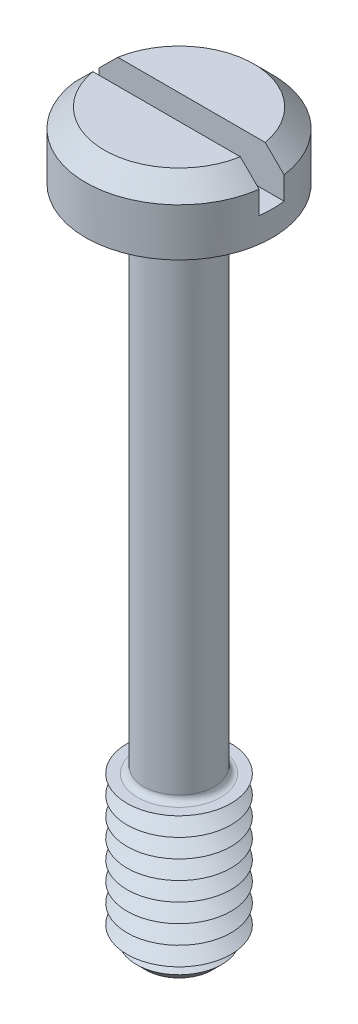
ISO-10303-21;
HEADER;
FILE_DESCRIPTION(('STEP AP214'),'2;1');
FILE_NAME('part.step','',(''),(''),'','','');
FILE_SCHEMA(('AUTOMOTIVE_DESIGN { 1 0 10303 214 1 1 1 1 }'));
ENDSEC;
DATA;
#1=APPLICATION_CONTEXT('core data for automotive mechanical design processes');
#2=APPLICATION_PROTOCOL_DEFINITION('international standard','automotive_design',2000,#1);
#3=PRODUCT_CONTEXT('',#1,'mechanical');
#4=PRODUCT('Part','Part','',(#3));
#5=PRODUCT_RELATED_PRODUCT_CATEGORY('part','',(#4));
#6=PRODUCT_DEFINITION_FORMATION('','',#4);
#7=PRODUCT_DEFINITION_CONTEXT('part definition',#1,'design');
#8=PRODUCT_DEFINITION('design','',#6,#7);
#9=PRODUCT_DEFINITION_SHAPE('','',#8);
#10=(LENGTH_UNIT() NAMED_UNIT(*) SI_UNIT(.MILLI.,.METRE.));
#11=(NAMED_UNIT(*) PLANE_ANGLE_UNIT() SI_UNIT($,.RADIAN.));
#12=(NAMED_UNIT(*) SI_UNIT($,.STERADIAN.) SOLID_ANGLE_UNIT());
#13=UNCERTAINTY_MEASURE_WITH_UNIT(LENGTH_MEASURE(1.E-05),#10,'distance_accuracy_value','');
#14=(GEOMETRIC_REPRESENTATION_CONTEXT(3) GLOBAL_UNCERTAINTY_ASSIGNED_CONTEXT((#13)) GLOBAL_UNIT_ASSIGNED_CONTEXT((#10,
#11,#12)) REPRESENTATION_CONTEXT('',''));
#15=CARTESIAN_POINT('',(0.,0.,0.));
#16=DIRECTION('',(0.,0.,1.));
#17=DIRECTION('',(1.,0.,0.));
#18=AXIS2_PLACEMENT_3D('',#15,#16,#17);
#19=CARTESIAN_POINT('',(0.,1.6,0.));
#20=DIRECTION('',(0.,1.,0.));
#21=DIRECTION('',(0.,0.,1.));
#22=AXIS2_PLACEMENT_3D('',#19,#20,#21);
#23=PLANE('',#22);
#24=DIRECTION('',(-1.,0.,0.));
#25=VECTOR('',#24,1.);
#26=CARTESIAN_POINT('',(2.25,1.6,-0.3));
#27=LINE('',#26,#25);
#28=CARTESIAN_POINT('',(1.77482393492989,1.6,-0.3));
#29=VERTEX_POINT('',#28);
#30=CARTESIAN_POINT('',(-1.77482393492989,1.6,-0.3));
#31=VERTEX_POINT('',#30);
#32=EDGE_CURVE('E110',#29,#31,#27,.T.);
#33=ORIENTED_EDGE('',*,*,#32,.F.);
#34=CARTESIAN_POINT('',(0.,1.6,0.));
#35=DIRECTION('',(0.,1.,0.));
#36=DIRECTION('',(0.,0.,1.));
#37=AXIS2_PLACEMENT_3D('',#34,#35,#36);
#38=CIRCLE('',#37,1.8);
#39=EDGE_CURVE('E113',#29,#31,#38,.T.);
#40=ORIENTED_EDGE('',*,*,#39,.T.);
#41=EDGE_LOOP('',(#33,#40));
#42=FACE_BOUND('',#41,.T.);
#43=ADVANCED_FACE('F39',(#42),#23,.T.);
#44=CARTESIAN_POINT('',(0.,1.6,0.));
#45=DIRECTION('',(0.,-1.,0.));
#46=DIRECTION('',(0.,0.,-1.));
#47=AXIS2_PLACEMENT_3D('',#44,#45,#46);
#48=CONICAL_SURFACE('',#47,1.8,0.785398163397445);
#49=CARTESIAN_POINT('',(4.95459224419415,-1.56366641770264,-0.3));
#50=CARTESIAN_POINT('',(4.78550585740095,-1.39489159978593,-0.3));
#51=CARTESIAN_POINT('',(4.6164059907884,-1.22613027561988,-0.3));
#52=CARTESIAN_POINT('',(4.27815962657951,-0.888649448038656,-0.3));
#53=CARTESIAN_POINT('',(4.10901312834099,-0.719929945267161,-0.3));
#54=CARTESIAN_POINT('',(3.77060374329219,-0.382497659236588,-0.3));
#55=CARTESIAN_POINT('',(3.60134083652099,-0.213784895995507,-0.3));
#56=CARTESIAN_POINT('',(3.26272497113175,0.123545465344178,-0.3));
#57=CARTESIAN_POINT('',(3.09337201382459,0.292163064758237,-0.3));
#58=CARTESIAN_POINT('',(2.74975444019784,0.633985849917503,-0.3));
#59=CARTESIAN_POINT('',(2.57548557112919,0.807186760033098,-0.3));
#60=CARTESIAN_POINT('',(2.22666801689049,1.15332162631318,-0.3));
#61=CARTESIAN_POINT('',(2.05211932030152,1.32625557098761,-0.3));
#62=CARTESIAN_POINT('',(1.78988225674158,1.58520097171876,-0.3));
#63=CARTESIAN_POINT('',(1.70241000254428,1.67143125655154,-0.3));
#64=CARTESIAN_POINT('',(1.52723599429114,1.84366185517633,-0.3));
#65=CARTESIAN_POINT('',(1.43953423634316,1.92966216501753,-0.3));
#66=CARTESIAN_POINT('',(1.26375483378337,2.10126365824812,-0.3));
#67=CARTESIAN_POINT('',(1.17567721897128,2.18686487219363,-0.3));
#68=CARTESIAN_POINT('',(0.998839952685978,2.35735922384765,-0.3));
#69=CARTESIAN_POINT('',(0.910080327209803,2.44225238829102,-0.3));
#70=CARTESIAN_POINT('',(0.796416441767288,2.54899153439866,-0.3));
#71=CARTESIAN_POINT('',(0.772225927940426,2.57159630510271,-0.3));
#72=CARTESIAN_POINT('',(0.723692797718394,2.61664290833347,-0.3));
#73=CARTESIAN_POINT('',(0.699350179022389,2.63908473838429,-0.3));
#74=CARTESIAN_POINT('',(0.650528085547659,2.68369783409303,-0.3));
#75=CARTESIAN_POINT('',(0.626049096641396,2.70586963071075,-0.3));
#76=CARTESIAN_POINT('',(0.576826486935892,2.74991696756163,-0.3));
#77=CARTESIAN_POINT('',(0.552082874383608,2.7717925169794,-0.3));
#78=CARTESIAN_POINT('',(0.495367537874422,2.82108684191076,-0.3));
#79=CARTESIAN_POINT('',(0.463281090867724,2.84837386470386,-0.3));
#80=CARTESIAN_POINT('',(0.398023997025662,2.90193742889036,-0.3));
#81=CARTESIAN_POINT('',(0.364849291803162,2.92820913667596,-0.3));
#82=CARTESIAN_POINT('',(0.313679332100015,2.96610502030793,-0.3));
#83=CARTESIAN_POINT('',(0.296293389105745,2.97854603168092,-0.3));
#84=CARTESIAN_POINT('',(0.260958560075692,3.0025951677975,-0.3));
#85=CARTESIAN_POINT('',(0.243009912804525,3.01420363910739,-0.3));
#86=CARTESIAN_POINT('',(0.206442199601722,3.0361249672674,-0.3));
#87=CARTESIAN_POINT('',(0.187826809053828,3.04644383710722,-0.3));
#88=CARTESIAN_POINT('',(0.149667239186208,3.06515059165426,-0.3));
#89=CARTESIAN_POINT('',(0.130125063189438,3.0735424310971,-0.3));
#90=CARTESIAN_POINT('',(0.089977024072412,3.08736060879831,-0.3));
#91=CARTESIAN_POINT('',(0.0693720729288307,3.09278944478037,-0.3));
#92=CARTESIAN_POINT('',(0.0275643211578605,3.0994305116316,-0.3));
#93=CARTESIAN_POINT('',(0.00636584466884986,3.10066782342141,-0.3));
#94=CARTESIAN_POINT('',(-0.0358007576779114,3.09861060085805,-0.3));
#95=CARTESIAN_POINT('',(-0.0567687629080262,3.09531379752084,-0.3));
#96=CARTESIAN_POINT('',(-0.097873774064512,3.08507807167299,-0.3));
#97=CARTESIAN_POINT('',(-0.118004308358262,3.07811501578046,-0.3));
#98=CARTESIAN_POINT('',(-0.162483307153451,3.05957916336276,-0.3));
#99=CARTESIAN_POINT('',(-0.186511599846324,3.04727044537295,-0.3));
#100=CARTESIAN_POINT('',(-0.23331864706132,3.02043354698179,-0.3));
#101=CARTESIAN_POINT('',(-0.256093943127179,3.00589960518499,-0.3));
#102=CARTESIAN_POINT('',(-0.300901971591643,2.97541580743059,-0.3));
#103=CARTESIAN_POINT('',(-0.322928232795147,2.95945657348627,-0.3));
#104=CARTESIAN_POINT('',(-0.366316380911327,2.92672827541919,-0.3));
#105=CARTESIAN_POINT('',(-0.387679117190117,2.90996032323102,-0.3));
#106=CARTESIAN_POINT('',(-0.433394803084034,2.87310399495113,-0.3));
#107=CARTESIAN_POINT('',(-0.457669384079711,2.85291891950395,-0.3));
#108=CARTESIAN_POINT('',(-0.505802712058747,2.81205752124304,-0.3));
#109=CARTESIAN_POINT('',(-0.529661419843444,2.79138115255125,-0.3));
#110=CARTESIAN_POINT('',(-0.600811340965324,2.72884009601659,-0.3));
#111=CARTESIAN_POINT('',(-0.647661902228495,2.68647545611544,-0.3));
#112=CARTESIAN_POINT('',(-0.740776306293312,2.60099002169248,-0.3));
#113=CARTESIAN_POINT('',(-0.787039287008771,2.55786829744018,-0.3));
#114=CARTESIAN_POINT('',(-0.879151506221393,2.4712020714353,-0.3));
#115=CARTESIAN_POINT('',(-0.92500081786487,2.42765764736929,-0.3));
#116=CARTESIAN_POINT('',(-1.0615734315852,2.29718252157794,-0.3));
#117=CARTESIAN_POINT('',(-1.15191647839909,2.20985470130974,-0.3));
#118=CARTESIAN_POINT('',(-1.33204374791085,2.03474740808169,-0.3));
#119=CARTESIAN_POINT('',(-1.42182830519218,1.94696827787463,-0.3));
#120=CARTESIAN_POINT('',(-1.65511823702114,1.71815111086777,-0.3));
#121=CARTESIAN_POINT('',(-1.79840096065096,1.57688614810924,-0.3));
#122=CARTESIAN_POINT('',(-2.08462326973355,1.29400744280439,-0.3));
#123=CARTESIAN_POINT('',(-2.22756285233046,1.15239369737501,-0.3));
#124=CARTESIAN_POINT('',(-2.65618391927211,0.727177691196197,-0.3));
#125=CARTESIAN_POINT('',(-2.94157972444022,0.443287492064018,-0.3));
#126=CARTESIAN_POINT('',(-3.51504981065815,-0.127735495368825,-0.3));
#127=CARTESIAN_POINT('',(-3.80312108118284,-0.414871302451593,-0.3));
#128=CARTESIAN_POINT('',(-4.37899985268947,-0.98921931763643,-0.3));
#129=CARTESIAN_POINT('',(-4.6668074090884,-1.27643147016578,-0.3));
#130=CARTESIAN_POINT('',(-4.95459224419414,-1.56366641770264,-0.3));
#131=B_SPLINE_CURVE_WITH_KNOTS('',3,(#49,#50,#51,#52,#53,#54,#55,#56,#57,#58,#59,#60,#61,#62,
#63,#64,#65,#66,#67,#68,#69,#70,#71,#72,#73,#74,#75,#76,#77,#78,#79,#80,#81,#82,#83,#84,#85,#86,
#87,#88,#89,#90,#91,#92,#93,#94,#95,#96,#97,#98,#99,#100,#101,#102,#103,#104,#105,#106,#107,
#108,#109,#110,#111,#112,#113,#114,#115,#116,#117,#118,#119,#120,#121,#122,#123,#124,#125,#126,
#127,#128,#129,#130),.UNSPECIFIED.,.F.,.F.,(4,2,2,2,2,2,2,2,2,2,2,2,2,2,2,2,2,2,2,2,2,2,2,2,2,2,
2,2,2,2,2,2,2,2,2,2,2,2,2,2,4),(0.,0.716712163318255,1.43343474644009,2.1503903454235,
2.86733577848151,3.6044339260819,4.3415629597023,4.71005096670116,5.07854526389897,
5.44701086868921,5.81546249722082,5.91478669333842,6.01411239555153,6.11319302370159,
6.21227057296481,6.33862193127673,6.46551497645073,6.52963544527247,6.59372906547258,
6.65751170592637,6.72116225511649,6.78475906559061,6.84797465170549,6.91122188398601,
6.97489074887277,7.05566851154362,7.13665907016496,7.21822852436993,7.29968885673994,
7.39438996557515,7.48909995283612,7.67857624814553,7.86830424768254,8.05799801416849,
8.43494407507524,8.81163695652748,9.41526715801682,10.0189023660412,11.2265436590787,
12.4467437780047,13.6665454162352),.UNSPECIFIED.);
#132=CARTESIAN_POINT('',(2.2299103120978,1.14999999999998,-0.3));
#133=VERTEX_POINT('',#132);
#134=EDGE_CURVE('E260',#133,#29,#131,.T.);
#135=ORIENTED_EDGE('',*,*,#134,.F.);
#136=CARTESIAN_POINT('',(0.,1.15,0.));
#137=DIRECTION('',(0.,1.,0.));
#138=DIRECTION('',(0.,0.,1.));
#139=AXIS2_PLACEMENT_3D('',#136,#137,#138);
#140=CIRCLE('',#139,2.25);
#141=CARTESIAN_POINT('',(-2.22991031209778,1.15,-0.3));
#142=VERTEX_POINT('',#141);
#143=EDGE_CURVE('E128',#142,#133,#140,.F.);
#144=ORIENTED_EDGE('',*,*,#143,.F.);
#145=EDGE_CURVE('E102',#31,#142,#131,.T.);
#146=ORIENTED_EDGE('',*,*,#145,.F.);
#147=ORIENTED_EDGE('',*,*,#39,.F.);
#148=EDGE_LOOP('',(#135,#144,#146,#147));
#149=FACE_BOUND('',#148,.T.);
#150=ADVANCED_FACE('F222',(#149),#48,.T.);
#151=CARTESIAN_POINT('',(0.,-16.,0.));
#152=DIRECTION('',(0.,1.,0.));
#153=DIRECTION('',(0.,0.,1.));
#154=AXIS2_PLACEMENT_3D('',#151,#152,#153);
#155=CYLINDRICAL_SURFACE('',#154,0.85);
#156=CARTESIAN_POINT('',(0.,-12.15,0.));
#157=DIRECTION('',(0.,-1.,0.));
#158=DIRECTION('',(0.,0.,-1.));
#159=AXIS2_PLACEMENT_3D('',#156,#157,#158);
#160=CIRCLE('',#159,0.85);
#161=CARTESIAN_POINT('',(0.,-12.15,-0.85));
#162=VERTEX_POINT('',#161);
#163=EDGE_CURVE('E123',#162,#162,#160,.F.);
#164=ORIENTED_EDGE('',*,*,#163,.T.);
#165=EDGE_LOOP('',(#164));
#166=FACE_BOUND('',#165,.T.);
#167=CARTESIAN_POINT('',(0.,-0.150000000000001,0.));
#168=DIRECTION('',(0.,1.,0.));
#169=DIRECTION('',(0.,0.,1.));
#170=AXIS2_PLACEMENT_3D('',#167,#168,#169);
#171=CIRCLE('',#170,0.85);
#172=CARTESIAN_POINT('',(0.,-0.150000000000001,0.85));
#173=VERTEX_POINT('',#172);
#174=EDGE_CURVE('E366',#173,#173,#171,.F.);
#175=ORIENTED_EDGE('',*,*,#174,.T.);
#176=EDGE_LOOP('',(#175));
#177=FACE_BOUND('',#176,.T.);
#178=ADVANCED_FACE('F218',(#166,#177),#155,.T.);
#179=CARTESIAN_POINT('',(0.,1.6,0.));
#180=DIRECTION('',(0.,-1.,0.));
#181=DIRECTION('',(0.,0.,-1.));
#182=AXIS2_PLACEMENT_3D('',#179,#180,#181);
#183=CYLINDRICAL_SURFACE('',#182,2.25);
#184=ORIENTED_EDGE('',*,*,#143,.T.);
#185=DIRECTION('',(0.,-1.,0.));
#186=VECTOR('',#185,1.);
#187=CARTESIAN_POINT('',(2.22991031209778,1.6,-0.3));
#188=LINE('',#187,#186);
#189=CARTESIAN_POINT('',(2.22991031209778,0.6,-0.3));
#190=VERTEX_POINT('',#189);
#191=EDGE_CURVE('E64',#133,#190,#188,.T.);
#192=ORIENTED_EDGE('',*,*,#191,.T.);
#193=CARTESIAN_POINT('',(0.,0.6,0.));
#194=DIRECTION('',(0.,1.,0.));
#195=DIRECTION('',(0.,0.,1.));
#196=AXIS2_PLACEMENT_3D('',#193,#194,#195);
#197=CIRCLE('',#196,2.25);
#198=CARTESIAN_POINT('',(2.22991031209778,0.6,0.3));
#199=VERTEX_POINT('',#198);
#200=EDGE_CURVE('E11',#199,#190,#197,.T.);
#201=ORIENTED_EDGE('',*,*,#200,.F.);
#202=DIRECTION('',(0.,-1.,0.));
#203=VECTOR('',#202,1.);
#204=CARTESIAN_POINT('',(2.22991031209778,1.6,0.3));
#205=LINE('',#204,#203);
#206=CARTESIAN_POINT('',(2.22991031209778,1.15,0.3));
#207=VERTEX_POINT('',#206);
#208=EDGE_CURVE('E277',#199,#207,#205,.F.);
#209=ORIENTED_EDGE('',*,*,#208,.T.);
#210=CARTESIAN_POINT('',(-2.2299103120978,1.14999999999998,0.3));
#211=VERTEX_POINT('',#210);
#212=EDGE_CURVE('E120',#207,#211,#140,.F.);
#213=ORIENTED_EDGE('',*,*,#212,.T.);
#214=DIRECTION('',(0.,-1.,0.));
#215=VECTOR('',#214,1.);
#216=CARTESIAN_POINT('',(-2.22991031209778,1.6,0.3));
#217=LINE('',#216,#215);
#218=CARTESIAN_POINT('',(-2.22991031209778,0.6,0.3));
#219=VERTEX_POINT('',#218);
#220=EDGE_CURVE('E96',#211,#219,#217,.T.);
#221=ORIENTED_EDGE('',*,*,#220,.T.);
#222=CARTESIAN_POINT('',(-2.22991031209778,0.6,-0.3));
#223=VERTEX_POINT('',#222);
#224=EDGE_CURVE('E44',#223,#219,#197,.T.);
#225=ORIENTED_EDGE('',*,*,#224,.F.);
#226=DIRECTION('',(0.,-1.,0.));
#227=VECTOR('',#226,1.);
#228=CARTESIAN_POINT('',(-2.22991031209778,1.6,-0.3));
#229=LINE('',#228,#227);
#230=EDGE_CURVE('E281',#223,#142,#229,.F.);
#231=ORIENTED_EDGE('',*,*,#230,.T.);
#232=EDGE_LOOP('',(#184,#192,#201,#209,#213,#221,#225,#231));
#233=FACE_BOUND('',#232,.T.);
#234=CARTESIAN_POINT('',(0.,0.,0.));
#235=DIRECTION('',(0.,1.,0.));
#236=DIRECTION('',(0.,0.,1.));
#237=AXIS2_PLACEMENT_3D('',#234,#235,#236);
#238=CIRCLE('',#237,2.25);
#239=CARTESIAN_POINT('',(0.,0.,2.25));
#240=VERTEX_POINT('',#239);
#241=EDGE_CURVE('E352',#240,#240,#238,.T.);
#242=ORIENTED_EDGE('',*,*,#241,.T.);
#243=EDGE_LOOP('',(#242));
#244=FACE_BOUND('',#243,.T.);
#245=ADVANCED_FACE('F221',(#233,#244),#183,.T.);
#246=DIRECTION('',(1.,0.,0.));
#247=VECTOR('',#246,1.);
#248=CARTESIAN_POINT('',(2.25,1.6,0.3));
#249=LINE('',#248,#247);
#250=CARTESIAN_POINT('',(-1.77482393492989,1.6,0.3));
#251=VERTEX_POINT('',#250);
#252=CARTESIAN_POINT('',(1.77482393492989,1.6,0.3));
#253=VERTEX_POINT('',#252);
#254=EDGE_CURVE('E56',#251,#253,#249,.T.);
#255=ORIENTED_EDGE('',*,*,#254,.F.);
#256=EDGE_CURVE('E108',#251,#253,#38,.T.);
#257=ORIENTED_EDGE('',*,*,#256,.T.);
#258=EDGE_LOOP('',(#255,#257));
#259=FACE_BOUND('',#258,.T.);
#260=ADVANCED_FACE('F107',(#259),#23,.T.);
#261=CARTESIAN_POINT('',(0.,0.,0.));
#262=DIRECTION('',(0.,1.,0.));
#263=DIRECTION('',(0.,0.,1.));
#264=AXIS2_PLACEMENT_3D('',#261,#262,#263);
#265=PLANE('',#264);
#266=CARTESIAN_POINT('',(0.,0.,0.));
#267=DIRECTION('',(0.,1.,0.));
#268=DIRECTION('',(0.,0.,1.));
#269=AXIS2_PLACEMENT_3D('',#266,#267,#268);
#270=CIRCLE('',#269,1.);
#271=CARTESIAN_POINT('',(0.,0.,1.));
#272=VERTEX_POINT('',#271);
#273=EDGE_CURVE('E114',#272,#272,#270,.T.);
#274=ORIENTED_EDGE('',*,*,#273,.T.);
#275=EDGE_LOOP('',(#274));
#276=FACE_BOUND('',#275,.T.);
#277=ORIENTED_EDGE('',*,*,#241,.F.);
#278=EDGE_LOOP('',(#277));
#279=FACE_BOUND('',#278,.T.);
#280=ADVANCED_FACE('F212',(#276,#279),#265,.F.);
#281=CARTESIAN_POINT('',(0.,-12.3,0.));
#282=DIRECTION('',(0.,-1.,0.));
#283=DIRECTION('',(0.,0.,-1.));
#284=AXIS2_PLACEMENT_3D('',#281,#282,#283);
#285=PLANE('',#284);
#286=CARTESIAN_POINT('',(0.,-12.3,0.));
#287=DIRECTION('',(0.,-1.,0.));
#288=DIRECTION('',(0.,0.,-1.));
#289=AXIS2_PLACEMENT_3D('',#286,#287,#288);
#290=CIRCLE('',#289,1.);
#291=CARTESIAN_POINT('',(0.,-12.3,-1.));
#292=VERTEX_POINT('',#291);
#293=EDGE_CURVE('E359',#292,#292,#290,.T.);
#294=ORIENTED_EDGE('',*,*,#293,.T.);
#295=EDGE_LOOP('',(#294));
#296=FACE_BOUND('',#295,.T.);
#297=CARTESIAN_POINT('',(0.,-12.3,0.));
#298=DIRECTION('',(0.,1.,0.));
#299=DIRECTION('',(0.,0.,1.));
#300=AXIS2_PLACEMENT_3D('',#297,#298,#299);
#301=CIRCLE('',#300,1.25);
#302=CARTESIAN_POINT('',(0.,-12.3,1.25));
#303=VERTEX_POINT('',#302);
#304=EDGE_CURVE('E348',#303,#303,#301,.T.);
#305=ORIENTED_EDGE('',*,*,#304,.T.);
#306=EDGE_LOOP('',(#305));
#307=FACE_BOUND('',#306,.T.);
#308=ADVANCED_FACE('F208',(#296,#307),#285,.F.);
#309=CARTESIAN_POINT('',(0.,-12.525,0.));
#310=DIRECTION('',(0.,1.,0.));
#311=DIRECTION('',(0.,0.,1.));
#312=AXIS2_PLACEMENT_3D('',#309,#310,#311);
#313=CONICAL_SURFACE('',#312,0.860288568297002,1.0471975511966);
#314=ORIENTED_EDGE('',*,*,#304,.F.);
#315=EDGE_LOOP('',(#314));
#316=FACE_BOUND('',#315,.T.);
#317=CARTESIAN_POINT('',(0.,-12.525,0.));
#318=DIRECTION('',(0.,1.,0.));
#319=DIRECTION('',(0.,0.,1.));
#320=AXIS2_PLACEMENT_3D('',#317,#318,#319);
#321=CIRCLE('',#320,0.860288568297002);
#322=CARTESIAN_POINT('',(0.,-12.525,0.860288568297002));
#323=VERTEX_POINT('',#322);
#324=EDGE_CURVE('E344',#323,#323,#321,.T.);
#325=ORIENTED_EDGE('',*,*,#324,.T.);
#326=EDGE_LOOP('',(#325));
#327=FACE_BOUND('',#326,.T.);
#328=ADVANCED_FACE('F204',(#316,#327),#313,.T.);
#329=CARTESIAN_POINT('',(0.,-12.75,0.));
#330=DIRECTION('',(0.,-1.,0.));
#331=DIRECTION('',(0.,0.,-1.));
#332=AXIS2_PLACEMENT_3D('',#329,#330,#331);
#333=CONICAL_SURFACE('',#332,1.25,1.0471975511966);
#334=ORIENTED_EDGE('',*,*,#324,.F.);
#335=EDGE_LOOP('',(#334));
#336=FACE_BOUND('',#335,.T.);
#337=CARTESIAN_POINT('',(0.,-12.75,0.));
#338=DIRECTION('',(0.,1.,0.));
#339=DIRECTION('',(0.,0.,1.));
#340=AXIS2_PLACEMENT_3D('',#337,#338,#339);
#341=CIRCLE('',#340,1.25);
#342=CARTESIAN_POINT('',(0.,-12.75,1.25));
#343=VERTEX_POINT('',#342);
#344=EDGE_CURVE('E340',#343,#343,#341,.T.);
#345=ORIENTED_EDGE('',*,*,#344,.T.);
#346=EDGE_LOOP('',(#345));
#347=FACE_BOUND('',#346,.T.);
#348=ADVANCED_FACE('F200',(#336,#347),#333,.T.);
#349=CARTESIAN_POINT('',(0.,-12.975,0.));
#350=DIRECTION('',(0.,1.,0.));
#351=DIRECTION('',(0.,0.,1.));
#352=AXIS2_PLACEMENT_3D('',#349,#350,#351);
#353=CONICAL_SURFACE('',#352,0.860288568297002,1.0471975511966);
#354=ORIENTED_EDGE('',*,*,#344,.F.);
#355=EDGE_LOOP('',(#354));
#356=FACE_BOUND('',#355,.T.);
#357=CARTESIAN_POINT('',(0.,-12.975,0.));
#358=DIRECTION('',(0.,1.,0.));
#359=DIRECTION('',(0.,0.,1.));
#360=AXIS2_PLACEMENT_3D('',#357,#358,#359);
#361=CIRCLE('',#360,0.860288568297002);
#362=CARTESIAN_POINT('',(0.,-12.975,0.860288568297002));
#363=VERTEX_POINT('',#362);
#364=EDGE_CURVE('E337',#363,#363,#361,.T.);
#365=ORIENTED_EDGE('',*,*,#364,.T.);
#366=EDGE_LOOP('',(#365));
#367=FACE_BOUND('',#366,.T.);
#368=ADVANCED_FACE('F196',(#356,#367),#353,.T.);
#369=CARTESIAN_POINT('',(0.,-13.2,0.));
#370=DIRECTION('',(0.,-1.,0.));
#371=DIRECTION('',(0.,0.,-1.));
#372=AXIS2_PLACEMENT_3D('',#369,#370,#371);
#373=CONICAL_SURFACE('',#372,1.25,1.0471975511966);
#374=ORIENTED_EDGE('',*,*,#364,.F.);
#375=EDGE_LOOP('',(#374));
#376=FACE_BOUND('',#375,.T.);
#377=CARTESIAN_POINT('',(0.,-13.2,0.));
#378=DIRECTION('',(0.,1.,0.));
#379=DIRECTION('',(0.,0.,1.));
#380=AXIS2_PLACEMENT_3D('',#377,#378,#379);
#381=CIRCLE('',#380,1.25);
#382=CARTESIAN_POINT('',(0.,-13.2,1.25));
#383=VERTEX_POINT('',#382);
#384=EDGE_CURVE('E333',#383,#383,#381,.T.);
#385=ORIENTED_EDGE('',*,*,#384,.T.);
#386=EDGE_LOOP('',(#385));
#387=FACE_BOUND('',#386,.T.);
#388=ADVANCED_FACE('F192',(#376,#387),#373,.T.);
#389=CARTESIAN_POINT('',(0.,-13.425,0.));
#390=DIRECTION('',(0.,1.,0.));
#391=DIRECTION('',(0.,0.,1.));
#392=AXIS2_PLACEMENT_3D('',#389,#390,#391);
#393=CONICAL_SURFACE('',#392,0.860288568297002,1.0471975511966);
#394=ORIENTED_EDGE('',*,*,#384,.F.);
#395=EDGE_LOOP('',(#394));
#396=FACE_BOUND('',#395,.T.);
#397=CARTESIAN_POINT('',(0.,-13.425,0.));
#398=DIRECTION('',(0.,1.,0.));
#399=DIRECTION('',(0.,0.,1.));
#400=AXIS2_PLACEMENT_3D('',#397,#398,#399);
#401=CIRCLE('',#400,0.860288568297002);
#402=CARTESIAN_POINT('',(0.,-13.425,0.860288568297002));
#403=VERTEX_POINT('',#402);
#404=EDGE_CURVE('E329',#403,#403,#401,.T.);
#405=ORIENTED_EDGE('',*,*,#404,.T.);
#406=EDGE_LOOP('',(#405));
#407=FACE_BOUND('',#406,.T.);
#408=ADVANCED_FACE('F188',(#396,#407),#393,.T.);
#409=CARTESIAN_POINT('',(0.,-13.65,0.));
#410=DIRECTION('',(0.,-1.,0.));
#411=DIRECTION('',(0.,0.,-1.));
#412=AXIS2_PLACEMENT_3D('',#409,#410,#411);
#413=CONICAL_SURFACE('',#412,1.25,1.0471975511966);
#414=ORIENTED_EDGE('',*,*,#404,.F.);
#415=EDGE_LOOP('',(#414));
#416=FACE_BOUND('',#415,.T.);
#417=CARTESIAN_POINT('',(0.,-13.65,0.));
#418=DIRECTION('',(0.,1.,0.));
#419=DIRECTION('',(0.,0.,1.));
#420=AXIS2_PLACEMENT_3D('',#417,#418,#419);
#421=CIRCLE('',#420,1.25);
#422=CARTESIAN_POINT('',(0.,-13.65,1.25));
#423=VERTEX_POINT('',#422);
#424=EDGE_CURVE('E325',#423,#423,#421,.T.);
#425=ORIENTED_EDGE('',*,*,#424,.T.);
#426=EDGE_LOOP('',(#425));
#427=FACE_BOUND('',#426,.T.);
#428=ADVANCED_FACE('F184',(#416,#427),#413,.T.);
#429=CARTESIAN_POINT('',(0.,-13.875,0.));
#430=DIRECTION('',(0.,1.,0.));
#431=DIRECTION('',(0.,0.,1.));
#432=AXIS2_PLACEMENT_3D('',#429,#430,#431);
#433=CONICAL_SURFACE('',#432,0.860288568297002,1.0471975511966);
#434=ORIENTED_EDGE('',*,*,#424,.F.);
#435=EDGE_LOOP('',(#434));
#436=FACE_BOUND('',#435,.T.);
#437=CARTESIAN_POINT('',(0.,-13.875,0.));
#438=DIRECTION('',(0.,1.,0.));
#439=DIRECTION('',(0.,0.,1.));
#440=AXIS2_PLACEMENT_3D('',#437,#438,#439);
#441=CIRCLE('',#440,0.860288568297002);
#442=CARTESIAN_POINT('',(0.,-13.875,0.860288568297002));
#443=VERTEX_POINT('',#442);
#444=EDGE_CURVE('E321',#443,#443,#441,.T.);
#445=ORIENTED_EDGE('',*,*,#444,.T.);
#446=EDGE_LOOP('',(#445));
#447=FACE_BOUND('',#446,.T.);
#448=ADVANCED_FACE('F180',(#436,#447),#433,.T.);
#449=CARTESIAN_POINT('',(0.,-14.1,0.));
#450=DIRECTION('',(0.,-1.,0.));
#451=DIRECTION('',(0.,0.,-1.));
#452=AXIS2_PLACEMENT_3D('',#449,#450,#451);
#453=CONICAL_SURFACE('',#452,1.25,1.0471975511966);
#454=ORIENTED_EDGE('',*,*,#444,.F.);
#455=EDGE_LOOP('',(#454));
#456=FACE_BOUND('',#455,.T.);
#457=CARTESIAN_POINT('',(0.,-14.1,0.));
#458=DIRECTION('',(0.,1.,0.));
#459=DIRECTION('',(0.,0.,1.));
#460=AXIS2_PLACEMENT_3D('',#457,#458,#459);
#461=CIRCLE('',#460,1.25);
#462=CARTESIAN_POINT('',(0.,-14.1,1.25));
#463=VERTEX_POINT('',#462);
#464=EDGE_CURVE('E317',#463,#463,#461,.T.);
#465=ORIENTED_EDGE('',*,*,#464,.T.);
#466=EDGE_LOOP('',(#465));
#467=FACE_BOUND('',#466,.T.);
#468=ADVANCED_FACE('F176',(#456,#467),#453,.T.);
#469=CARTESIAN_POINT('',(0.,-14.325,0.));
#470=DIRECTION('',(0.,1.,0.));
#471=DIRECTION('',(0.,0.,1.));
#472=AXIS2_PLACEMENT_3D('',#469,#470,#471);
#473=CONICAL_SURFACE('',#472,0.860288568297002,1.0471975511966);
#474=ORIENTED_EDGE('',*,*,#464,.F.);
#475=EDGE_LOOP('',(#474));
#476=FACE_BOUND('',#475,.T.);
#477=CARTESIAN_POINT('',(0.,-14.325,0.));
#478=DIRECTION('',(0.,1.,0.));
#479=DIRECTION('',(0.,0.,1.));
#480=AXIS2_PLACEMENT_3D('',#477,#478,#479);
#481=CIRCLE('',#480,0.860288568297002);
#482=CARTESIAN_POINT('',(0.,-14.325,0.860288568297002));
#483=VERTEX_POINT('',#482);
#484=EDGE_CURVE('E313',#483,#483,#481,.T.);
#485=ORIENTED_EDGE('',*,*,#484,.T.);
#486=EDGE_LOOP('',(#485));
#487=FACE_BOUND('',#486,.T.);
#488=ADVANCED_FACE('F172',(#476,#487),#473,.T.);
#489=CARTESIAN_POINT('',(0.,-14.55,0.));
#490=DIRECTION('',(0.,-1.,0.));
#491=DIRECTION('',(0.,0.,-1.));
#492=AXIS2_PLACEMENT_3D('',#489,#490,#491);
#493=CONICAL_SURFACE('',#492,1.25,1.0471975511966);
#494=ORIENTED_EDGE('',*,*,#484,.F.);
#495=EDGE_LOOP('',(#494));
#496=FACE_BOUND('',#495,.T.);
#497=CARTESIAN_POINT('',(0.,-14.55,0.));
#498=DIRECTION('',(0.,1.,0.));
#499=DIRECTION('',(0.,0.,1.));
#500=AXIS2_PLACEMENT_3D('',#497,#498,#499);
#501=CIRCLE('',#500,1.25);
#502=CARTESIAN_POINT('',(0.,-14.55,1.25));
#503=VERTEX_POINT('',#502);
#504=EDGE_CURVE('E309',#503,#503,#501,.T.);
#505=ORIENTED_EDGE('',*,*,#504,.T.);
#506=EDGE_LOOP('',(#505));
#507=FACE_BOUND('',#506,.T.);
#508=ADVANCED_FACE('F168',(#496,#507),#493,.T.);
#509=CARTESIAN_POINT('',(0.,-14.775,0.));
#510=DIRECTION('',(0.,1.,0.));
#511=DIRECTION('',(0.,0.,1.));
#512=AXIS2_PLACEMENT_3D('',#509,#510,#511);
#513=CONICAL_SURFACE('',#512,0.860288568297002,1.0471975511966);
#514=ORIENTED_EDGE('',*,*,#504,.F.);
#515=EDGE_LOOP('',(#514));
#516=FACE_BOUND('',#515,.T.);
#517=CARTESIAN_POINT('',(0.,-14.775,0.));
#518=DIRECTION('',(0.,1.,0.));
#519=DIRECTION('',(0.,0.,1.));
#520=AXIS2_PLACEMENT_3D('',#517,#518,#519);
#521=CIRCLE('',#520,0.860288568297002);
#522=CARTESIAN_POINT('',(0.,-14.775,0.860288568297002));
#523=VERTEX_POINT('',#522);
#524=EDGE_CURVE('E305',#523,#523,#521,.T.);
#525=ORIENTED_EDGE('',*,*,#524,.T.);
#526=EDGE_LOOP('',(#525));
#527=FACE_BOUND('',#526,.T.);
#528=ADVANCED_FACE('F164',(#516,#527),#513,.T.);
#529=CARTESIAN_POINT('',(0.,-15.,0.));
#530=DIRECTION('',(0.,-1.,0.));
#531=DIRECTION('',(0.,0.,-1.));
#532=AXIS2_PLACEMENT_3D('',#529,#530,#531);
#533=CONICAL_SURFACE('',#532,1.25,1.0471975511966);
#534=ORIENTED_EDGE('',*,*,#524,.F.);
#535=EDGE_LOOP('',(#534));
#536=FACE_BOUND('',#535,.T.);
#537=CARTESIAN_POINT('',(0.,-15.,0.));
#538=DIRECTION('',(0.,1.,0.));
#539=DIRECTION('',(0.,0.,1.));
#540=AXIS2_PLACEMENT_3D('',#537,#538,#539);
#541=CIRCLE('',#540,1.25);
#542=CARTESIAN_POINT('',(0.,-15.,1.25));
#543=VERTEX_POINT('',#542);
#544=EDGE_CURVE('E302',#543,#543,#541,.T.);
#545=ORIENTED_EDGE('',*,*,#544,.T.);
#546=EDGE_LOOP('',(#545));
#547=FACE_BOUND('',#546,.T.);
#548=ADVANCED_FACE('F160',(#536,#547),#533,.T.);
#549=CARTESIAN_POINT('',(0.,-15.225,0.));
#550=DIRECTION('',(0.,1.,0.));
#551=DIRECTION('',(0.,0.,1.));
#552=AXIS2_PLACEMENT_3D('',#549,#550,#551);
#553=CONICAL_SURFACE('',#552,0.860288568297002,1.0471975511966);
#554=ORIENTED_EDGE('',*,*,#544,.F.);
#555=EDGE_LOOP('',(#554));
#556=FACE_BOUND('',#555,.T.);
#557=CARTESIAN_POINT('',(0.,-15.225,0.));
#558=DIRECTION('',(0.,1.,0.));
#559=DIRECTION('',(0.,0.,1.));
#560=AXIS2_PLACEMENT_3D('',#557,#558,#559);
#561=CIRCLE('',#560,0.860288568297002);
#562=CARTESIAN_POINT('',(0.,-15.225,0.860288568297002));
#563=VERTEX_POINT('',#562);
#564=EDGE_CURVE('E299',#563,#563,#561,.T.);
#565=ORIENTED_EDGE('',*,*,#564,.T.);
#566=EDGE_LOOP('',(#565));
#567=FACE_BOUND('',#566,.T.);
#568=ADVANCED_FACE('F156',(#556,#567),#553,.T.);
#569=CARTESIAN_POINT('',(0.,-15.45,0.));
#570=DIRECTION('',(0.,-1.,0.));
#571=DIRECTION('',(0.,0.,-1.));
#572=AXIS2_PLACEMENT_3D('',#569,#570,#571);
#573=CONICAL_SURFACE('',#572,1.25,1.0471975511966);
#574=ORIENTED_EDGE('',*,*,#564,.F.);
#575=EDGE_LOOP('',(#574));
#576=FACE_BOUND('',#575,.T.);
#577=CARTESIAN_POINT('',(0.,-15.45,0.));
#578=DIRECTION('',(0.,1.,0.));
#579=DIRECTION('',(0.,0.,1.));
#580=AXIS2_PLACEMENT_3D('',#577,#578,#579);
#581=CIRCLE('',#580,1.25);
#582=CARTESIAN_POINT('',(0.,-15.45,1.25));
#583=VERTEX_POINT('',#582);
#584=EDGE_CURVE('E294',#583,#583,#581,.T.);
#585=ORIENTED_EDGE('',*,*,#584,.T.);
#586=EDGE_LOOP('',(#585));
#587=FACE_BOUND('',#586,.T.);
#588=ADVANCED_FACE('F152',(#576,#587),#573,.T.);
#589=CARTESIAN_POINT('',(0.,-15.675,0.));
#590=DIRECTION('',(0.,1.,0.));
#591=DIRECTION('',(0.,0.,1.));
#592=AXIS2_PLACEMENT_3D('',#589,#590,#591);
#593=CONICAL_SURFACE('',#592,0.860288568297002,1.0471975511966);
#594=ORIENTED_EDGE('',*,*,#584,.F.);
#595=EDGE_LOOP('',(#594));
#596=FACE_BOUND('',#595,.T.);
#597=CARTESIAN_POINT('',(0.,-15.675,0.));
#598=DIRECTION('',(0.,1.,0.));
#599=DIRECTION('',(0.,0.,1.));
#600=AXIS2_PLACEMENT_3D('',#597,#598,#599);
#601=CIRCLE('',#600,0.860288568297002);
#602=CARTESIAN_POINT('',(0.,-15.675,0.860288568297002));
#603=VERTEX_POINT('',#602);
#604=EDGE_CURVE('E290',#603,#603,#601,.T.);
#605=ORIENTED_EDGE('',*,*,#604,.T.);
#606=EDGE_LOOP('',(#605));
#607=FACE_BOUND('',#606,.T.);
#608=ADVANCED_FACE('F148',(#596,#607),#593,.T.);
#609=CARTESIAN_POINT('',(0.,-15.9,0.));
#610=DIRECTION('',(0.,-1.,0.));
#611=DIRECTION('',(0.,0.,-1.));
#612=AXIS2_PLACEMENT_3D('',#609,#610,#611);
#613=CONICAL_SURFACE('',#612,1.25,1.0471975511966);
#614=CARTESIAN_POINT('',(0.,-15.7718911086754,0.));
#615=DIRECTION('',(0.,-1.,0.));
#616=DIRECTION('',(0.,0.,-1.));
#617=AXIS2_PLACEMENT_3D('',#614,#615,#616);
#618=CIRCLE('',#617,1.02810889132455);
#619=CARTESIAN_POINT('',(0.,-15.7718911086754,-1.02810889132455));
#620=VERTEX_POINT('',#619);
#621=EDGE_CURVE('E298',#620,#620,#618,.F.);
#622=ORIENTED_EDGE('',*,*,#621,.T.);
#623=EDGE_LOOP('',(#622));
#624=FACE_BOUND('',#623,.T.);
#625=ORIENTED_EDGE('',*,*,#604,.F.);
#626=EDGE_LOOP('',(#625));
#627=FACE_BOUND('',#626,.T.);
#628=ADVANCED_FACE('F144',(#624,#627),#613,.T.);
#629=CARTESIAN_POINT('',(0.,-16.,0.));
#630=DIRECTION('',(0.,-1.,0.));
#631=DIRECTION('',(0.,0.,-1.));
#632=AXIS2_PLACEMENT_3D('',#629,#630,#631);
#633=PLANE('',#632);
#634=CARTESIAN_POINT('',(0.,-16.,0.));
#635=DIRECTION('',(0.,-1.,0.));
#636=DIRECTION('',(0.,0.,-1.));
#637=AXIS2_PLACEMENT_3D('',#634,#635,#636);
#638=CIRCLE('',#637,0.800000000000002);
#639=CARTESIAN_POINT('',(0.,-16.,-0.800000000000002));
#640=VERTEX_POINT('',#639);
#641=EDGE_CURVE('E355',#640,#640,#638,.T.);
#642=ORIENTED_EDGE('',*,*,#641,.T.);
#643=EDGE_LOOP('',(#642));
#644=FACE_BOUND('',#643,.T.);
#645=ADVANCED_FACE('F147',(#644),#633,.T.);
#646=CARTESIAN_POINT('',(0.,-16.,0.));
#647=DIRECTION('',(0.,1.,0.));
#648=DIRECTION('',(0.,0.,1.));
#649=AXIS2_PLACEMENT_3D('',#646,#647,#648);
#650=CONICAL_SURFACE('',#649,0.800000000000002,0.785398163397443);
#651=ORIENTED_EDGE('',*,*,#621,.F.);
#652=EDGE_LOOP('',(#651));
#653=FACE_BOUND('',#652,.T.);
#654=ORIENTED_EDGE('',*,*,#641,.F.);
#655=EDGE_LOOP('',(#654));
#656=FACE_BOUND('',#655,.T.);
#657=ADVANCED_FACE('F216',(#653,#656),#650,.T.);
#658=CARTESIAN_POINT('',(0.,-12.15,0.));
#659=DIRECTION('',(0.,-1.,0.));
#660=DIRECTION('',(0.,0.,-1.));
#661=AXIS2_PLACEMENT_3D('',#658,#659,#660);
#662=TOROIDAL_SURFACE('',#661,1.,0.15);
#663=ORIENTED_EDGE('',*,*,#163,.F.);
#664=EDGE_LOOP('',(#663));
#665=FACE_BOUND('',#664,.T.);
#666=ORIENTED_EDGE('',*,*,#293,.F.);
#667=EDGE_LOOP('',(#666));
#668=FACE_BOUND('',#667,.T.);
#669=ADVANCED_FACE('F234',(#665,#668),#662,.F.);
#670=CARTESIAN_POINT('',(0.,-0.150000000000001,0.));
#671=DIRECTION('',(0.,1.,0.));
#672=DIRECTION('',(0.,0.,1.));
#673=AXIS2_PLACEMENT_3D('',#670,#671,#672);
#674=TOROIDAL_SURFACE('',#673,1.,0.15);
#675=ORIENTED_EDGE('',*,*,#273,.F.);
#676=EDGE_LOOP('',(#675));
#677=FACE_BOUND('',#676,.T.);
#678=ORIENTED_EDGE('',*,*,#174,.F.);
#679=EDGE_LOOP('',(#678));
#680=FACE_BOUND('',#679,.T.);
#681=ADVANCED_FACE('F237',(#677,#680),#674,.F.);
#682=CARTESIAN_POINT('',(-4.95459224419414,-1.56366641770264,0.3));
#683=CARTESIAN_POINT('',(-4.78550585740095,-1.39489159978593,0.3));
#684=CARTESIAN_POINT('',(-4.61640599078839,-1.22613027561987,0.3));
#685=CARTESIAN_POINT('',(-4.27815962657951,-0.888649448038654,0.3));
#686=CARTESIAN_POINT('',(-4.10901312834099,-0.71992994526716,0.3));
#687=CARTESIAN_POINT('',(-3.77060374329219,-0.382497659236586,0.3));
#688=CARTESIAN_POINT('',(-3.60134083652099,-0.213784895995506,0.3));
#689=CARTESIAN_POINT('',(-3.26272497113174,0.123545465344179,0.3));
#690=CARTESIAN_POINT('',(-3.09337201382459,0.292163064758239,0.3));
#691=CARTESIAN_POINT('',(-2.74975444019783,0.633985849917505,0.3));
#692=CARTESIAN_POINT('',(-2.57548557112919,0.8071867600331,0.3));
#693=CARTESIAN_POINT('',(-2.22666801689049,1.15332162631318,0.3));
#694=CARTESIAN_POINT('',(-2.05211932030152,1.32625557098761,0.3));
#695=CARTESIAN_POINT('',(-1.78988225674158,1.58520097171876,0.3));
#696=CARTESIAN_POINT('',(-1.70241000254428,1.67143125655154,0.3));
#697=CARTESIAN_POINT('',(-1.52723599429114,1.84366185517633,0.3));
#698=CARTESIAN_POINT('',(-1.43953423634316,1.92966216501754,0.3));
#699=CARTESIAN_POINT('',(-1.26375483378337,2.10126365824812,0.3));
#700=CARTESIAN_POINT('',(-1.17567721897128,2.18686487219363,0.3));
#701=CARTESIAN_POINT('',(-0.998839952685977,2.35735922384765,0.3));
#702=CARTESIAN_POINT('',(-0.910080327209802,2.44225238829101,0.3));
#703=CARTESIAN_POINT('',(-0.796416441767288,2.54899153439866,0.3));
#704=CARTESIAN_POINT('',(-0.772225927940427,2.57159630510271,0.3));
#705=CARTESIAN_POINT('',(-0.723692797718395,2.61664290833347,0.3));
#706=CARTESIAN_POINT('',(-0.69935017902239,2.63908473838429,0.3));
#707=CARTESIAN_POINT('',(-0.650528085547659,2.68369783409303,0.3));
#708=CARTESIAN_POINT('',(-0.626049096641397,2.70586963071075,0.3));
#709=CARTESIAN_POINT('',(-0.576826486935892,2.74991696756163,0.3));
#710=CARTESIAN_POINT('',(-0.552082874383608,2.7717925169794,0.3));
#711=CARTESIAN_POINT('',(-0.495367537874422,2.82108684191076,0.3));
#712=CARTESIAN_POINT('',(-0.463281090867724,2.84837386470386,0.3));
#713=CARTESIAN_POINT('',(-0.398023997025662,2.90193742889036,0.3));
#714=CARTESIAN_POINT('',(-0.364849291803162,2.92820913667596,0.3));
#715=CARTESIAN_POINT('',(-0.313679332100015,2.96610502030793,0.3));
#716=CARTESIAN_POINT('',(-0.296293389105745,2.97854603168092,0.3));
#717=CARTESIAN_POINT('',(-0.260958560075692,3.0025951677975,0.3));
#718=CARTESIAN_POINT('',(-0.243009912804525,3.01420363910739,0.3));
#719=CARTESIAN_POINT('',(-0.206442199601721,3.0361249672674,0.3));
#720=CARTESIAN_POINT('',(-0.187826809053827,3.04644383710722,0.3));
#721=CARTESIAN_POINT('',(-0.149667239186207,3.06515059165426,0.3));
#722=CARTESIAN_POINT('',(-0.130125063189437,3.0735424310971,0.3));
#723=CARTESIAN_POINT('',(-0.0899770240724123,3.08736060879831,0.3));
#724=CARTESIAN_POINT('',(-0.0693720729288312,3.09278944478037,0.3));
#725=CARTESIAN_POINT('',(-0.0275643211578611,3.0994305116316,0.3));
#726=CARTESIAN_POINT('',(-0.00636584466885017,3.10066782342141,0.3));
#727=CARTESIAN_POINT('',(0.0358007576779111,3.09861060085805,0.3));
#728=CARTESIAN_POINT('',(0.0567687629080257,3.09531379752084,0.3));
#729=CARTESIAN_POINT('',(0.0978737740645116,3.08507807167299,0.3));
#730=CARTESIAN_POINT('',(0.118004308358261,3.07811501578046,0.3));
#731=CARTESIAN_POINT('',(0.162483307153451,3.05957916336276,0.3));
#732=CARTESIAN_POINT('',(0.186511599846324,3.04727044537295,0.3));
#733=CARTESIAN_POINT('',(0.23331864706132,3.02043354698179,0.3));
#734=CARTESIAN_POINT('',(0.256093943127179,3.00589960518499,0.3));
#735=CARTESIAN_POINT('',(0.300901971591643,2.97541580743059,0.3));
#736=CARTESIAN_POINT('',(0.322928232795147,2.95945657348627,0.3));
#737=CARTESIAN_POINT('',(0.366316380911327,2.92672827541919,0.3));
#738=CARTESIAN_POINT('',(0.387679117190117,2.90996032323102,0.3));
#739=CARTESIAN_POINT('',(0.433394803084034,2.87310399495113,0.3));
#740=CARTESIAN_POINT('',(0.45766938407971,2.85291891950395,0.3));
#741=CARTESIAN_POINT('',(0.505802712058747,2.81205752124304,0.3));
#742=CARTESIAN_POINT('',(0.529661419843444,2.79138115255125,0.3));
#743=CARTESIAN_POINT('',(0.600811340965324,2.72884009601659,0.3));
#744=CARTESIAN_POINT('',(0.647661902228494,2.68647545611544,0.3));
#745=CARTESIAN_POINT('',(0.740776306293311,2.60099002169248,0.3));
#746=CARTESIAN_POINT('',(0.78703928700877,2.55786829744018,0.3));
#747=CARTESIAN_POINT('',(0.879151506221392,2.47120207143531,0.3));
#748=CARTESIAN_POINT('',(0.925000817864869,2.42765764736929,0.3));
#749=CARTESIAN_POINT('',(1.0615734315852,2.29718252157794,0.3));
#750=CARTESIAN_POINT('',(1.15191647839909,2.20985470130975,0.3));
#751=CARTESIAN_POINT('',(1.33204374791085,2.03474740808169,0.3));
#752=CARTESIAN_POINT('',(1.42182830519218,1.94696827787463,0.3));
#753=CARTESIAN_POINT('',(1.65511823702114,1.71815111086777,0.3));
#754=CARTESIAN_POINT('',(1.79840096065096,1.57688614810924,0.3));
#755=CARTESIAN_POINT('',(2.08462326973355,1.29400744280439,0.3));
#756=CARTESIAN_POINT('',(2.22756285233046,1.15239369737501,0.3));
#757=CARTESIAN_POINT('',(2.65618391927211,0.727177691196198,0.3));
#758=CARTESIAN_POINT('',(2.94157972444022,0.443287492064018,0.3));
#759=CARTESIAN_POINT('',(3.51504981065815,-0.127735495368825,0.3));
#760=CARTESIAN_POINT('',(3.80312108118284,-0.414871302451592,0.3));
#761=CARTESIAN_POINT('',(4.37899985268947,-0.989219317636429,0.3));
#762=CARTESIAN_POINT('',(4.6668074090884,-1.27643147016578,0.3));
#763=CARTESIAN_POINT('',(4.95459224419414,-1.56366641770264,0.3));
#764=B_SPLINE_CURVE_WITH_KNOTS('',3,(#682,#683,#684,#685,#686,#687,#688,#689,#690,#691,#692,
#693,#694,#695,#696,#697,#698,#699,#700,#701,#702,#703,#704,#705,#706,#707,#708,#709,#710,#711,
#712,#713,#714,#715,#716,#717,#718,#719,#720,#721,#722,#723,#724,#725,#726,#727,#728,#729,#730,
#731,#732,#733,#734,#735,#736,#737,#738,#739,#740,#741,#742,#743,#744,#745,#746,#747,#748,#749,
#750,#751,#752,#753,#754,#755,#756,#757,#758,#759,#760,#761,#762,#763),.UNSPECIFIED.,.F.,.F.,(4,
2,2,2,2,2,2,2,2,2,2,2,2,2,2,2,2,2,2,2,2,2,2,2,2,2,2,2,2,2,2,2,2,2,2,2,2,2,2,2,4),(0.,
0.716712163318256,1.43343474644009,2.1503903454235,2.86733577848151,3.6044339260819,
4.3415629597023,4.71005096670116,5.07854526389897,5.44701086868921,5.81546249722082,
5.91478669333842,6.01411239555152,6.11319302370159,6.21227057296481,6.33862193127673,
6.46551497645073,6.52963544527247,6.59372906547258,6.65751170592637,6.72116225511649,
6.78475906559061,6.84797465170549,6.91122188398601,6.97489074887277,7.05566851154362,
7.13665907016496,7.21822852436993,7.29968885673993,7.39438996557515,7.48909995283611,
7.67857624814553,7.86830424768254,8.05799801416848,8.43494407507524,8.81163695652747,
9.41526715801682,10.0189023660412,11.2265436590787,12.4467437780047,13.6665454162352),.UNSPECIFIED.);
#765=EDGE_CURVE('E92',#211,#251,#764,.T.);
#766=ORIENTED_EDGE('',*,*,#765,.F.);
#767=ORIENTED_EDGE('',*,*,#212,.F.);
#768=EDGE_CURVE('E103',#253,#207,#764,.T.);
#769=ORIENTED_EDGE('',*,*,#768,.F.);
#770=ORIENTED_EDGE('',*,*,#256,.F.);
#771=EDGE_LOOP('',(#766,#767,#769,#770));
#772=FACE_BOUND('',#771,.T.);
#773=ADVANCED_FACE('F41',(#772),#48,.T.);
#774=CARTESIAN_POINT('',(0.,0.6,0.));
#775=DIRECTION('',(0.,1.,0.));
#776=DIRECTION('',(0.,0.,1.));
#777=AXIS2_PLACEMENT_3D('',#774,#775,#776);
#778=PLANE('',#777);
#779=DIRECTION('',(1.,0.,0.));
#780=VECTOR('',#779,1.);
#781=CARTESIAN_POINT('',(2.25,0.6,0.3));
#782=LINE('',#781,#780);
#783=EDGE_CURVE('E257',#219,#199,#782,.T.);
#784=ORIENTED_EDGE('',*,*,#783,.T.);
#785=ORIENTED_EDGE('',*,*,#200,.T.);
#786=DIRECTION('',(-1.,0.,0.));
#787=VECTOR('',#786,1.);
#788=CARTESIAN_POINT('',(2.25,0.6,-0.3));
#789=LINE('',#788,#787);
#790=EDGE_CURVE('E274',#190,#223,#789,.T.);
#791=ORIENTED_EDGE('',*,*,#790,.T.);
#792=ORIENTED_EDGE('',*,*,#224,.T.);
#793=EDGE_LOOP('',(#784,#785,#791,#792));
#794=FACE_BOUND('',#793,.T.);
#795=ADVANCED_FACE('F244',(#794),#778,.T.);
#796=CARTESIAN_POINT('',(2.25,0.6,-0.3));
#797=DIRECTION('',(0.,0.,-1.));
#798=DIRECTION('',(-1.,0.,0.));
#799=AXIS2_PLACEMENT_3D('',#796,#797,#798);
#800=PLANE('',#799);
#801=ORIENTED_EDGE('',*,*,#134,.T.);
#802=ORIENTED_EDGE('',*,*,#32,.T.);
#803=ORIENTED_EDGE('',*,*,#145,.T.);
#804=ORIENTED_EDGE('',*,*,#230,.F.);
#805=ORIENTED_EDGE('',*,*,#790,.F.);
#806=ORIENTED_EDGE('',*,*,#191,.F.);
#807=EDGE_LOOP('',(#801,#802,#803,#804,#805,#806));
#808=FACE_BOUND('',#807,.T.);
#809=ADVANCED_FACE('F141',(#808),#800,.F.);
#810=CARTESIAN_POINT('',(2.25,0.6,0.3));
#811=DIRECTION('',(0.,0.,1.));
#812=DIRECTION('',(1.,0.,0.));
#813=AXIS2_PLACEMENT_3D('',#810,#811,#812);
#814=PLANE('',#813);
#815=ORIENTED_EDGE('',*,*,#765,.T.);
#816=ORIENTED_EDGE('',*,*,#254,.T.);
#817=ORIENTED_EDGE('',*,*,#768,.T.);
#818=ORIENTED_EDGE('',*,*,#208,.F.);
#819=ORIENTED_EDGE('',*,*,#783,.F.);
#820=ORIENTED_EDGE('',*,*,#220,.F.);
#821=EDGE_LOOP('',(#815,#816,#817,#818,#819,#820));
#822=FACE_BOUND('',#821,.T.);
#823=ADVANCED_FACE('F93',(#822),#814,.F.);
#824=CLOSED_SHELL('',(#43,#150,#178,#245,#260,#280,#308,#328,#348,#368,#388,#408,#428,#448,#468,
#488,#508,#528,#548,#568,#588,#608,#628,#645,#657,#669,#681,#773,#795,#809,#823));
#825=MANIFOLD_SOLID_BREP('B2',#824);
#826=ADVANCED_BREP_SHAPE_REPRESENTATION('',(#18,#825),#14);
#827=SHAPE_DEFINITION_REPRESENTATION(#9,#826);
ENDSEC;
END-ISO-10303-21;
